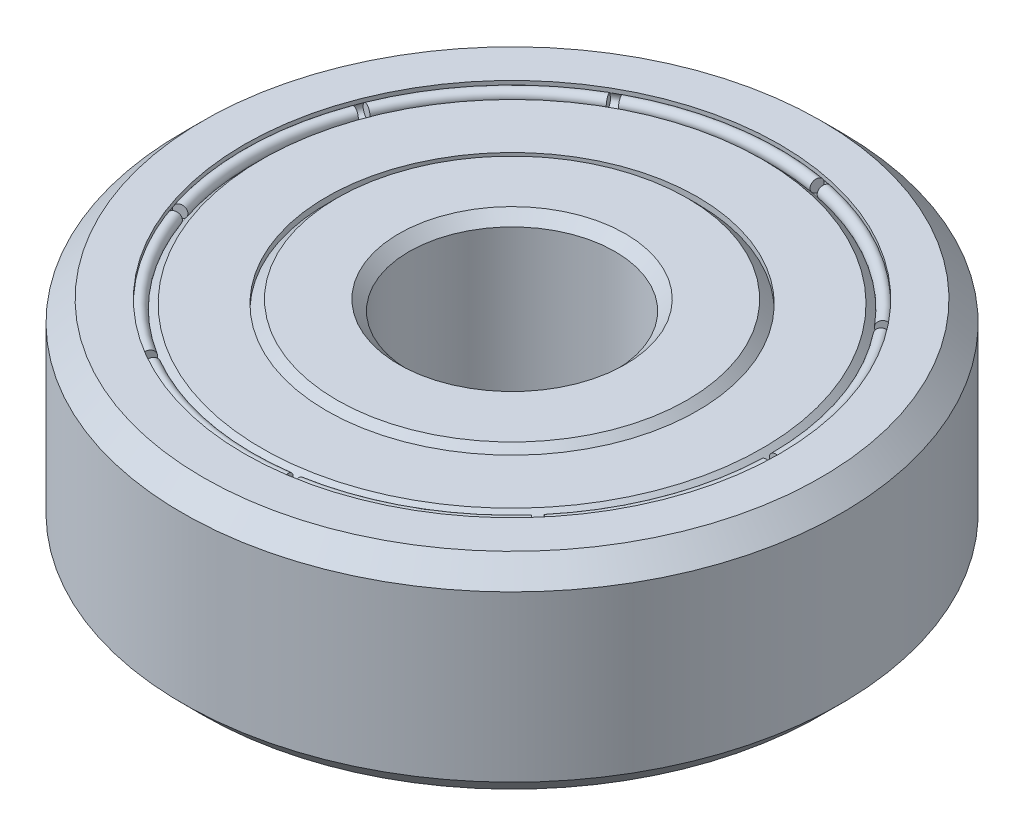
from build123d import *

# Parameters (mm, degrees)
SKETCH2_R         = 0.15
REVOLVE2_ANGLE    = 38
CIRPATTERN1_COUNT = 9


with BuildPart() as part:
    # Sketch1 → Revolve1 (revolve)
    with BuildSketch(Plane.XY, mode=Mode.PRIVATE) as revolve1_sk:
        with BuildLine():
            Line((2.5, -2.25), (2.5, 2.25))
            Line((2.5, 2.25), (2.75, 2.5))
            Line((2.75, 2.5), (4.25, 2.5))
            Line((4.25, 2.5), (4.5, 2.25))
            Line((4.5, 2.25), (4.5, 2.4))
            Line((4.5, 2.4), (6.075735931, 2.4))
            Line((6.075735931, 2.4), (6.287867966, 2.187867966))
            ThreePointArc((6.287867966, 2.187867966), (6.5, 2.187867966), (6.5, 2.4))
            Line((6.5, 2.4), (6.5, 2.5))
            Line((6.5, 2.5), (7.5, 2.5))
            Line((7.5, 2.5), (8, 2))
            Line((8, 2), (8, -2))
            Line((8, -2), (7.5, -2.5))
            Line((7.5, -2.5), (6.5, -2.5))
            Line((6.5, -2.5), (6.5, -2.4))
            ThreePointArc((6.5, -2.4), (6.5, -2.187867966), (6.287867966, -2.187867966))
            Line((6.287867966, -2.187867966), (6.075735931, -2.4))
            Line((6.075735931, -2.4), (4.5, -2.4))
            Line((4.5, -2.4), (4.5, -2.25))
            Line((4.5, -2.25), (4.25, -2.5))
            Line((4.25, -2.5), (2.75, -2.5))
            Line((2.75, -2.5), (2.5, -2.25))
        make_face()
    revolve(revolve1_sk.sketch.rotate(Axis((0, 0, 0), (0, 1, 0)), 90), axis=Axis((0, 0, 0), (0, 1, 0)))


with BuildPart() as body_2:
    # Sketch2 → Revolve2 (revolve)
    with BuildSketch(Plane.XY):
        with Locations((6.393933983, -2.293933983)):
            Circle(SKETCH2_R)
    revolve(axis=Axis((0, 0, 0), (0, 1, 0)), revolution_arc=REVOLVE2_ANGLE)


with BuildPart() as cirpattern1_1:
    # CirPattern1: pattern copy
    add(body_2.part.rotate(Axis((0, 0, 0), (0, 1, 0)), 1 * 360 / CIRPATTERN1_COUNT))


with BuildPart() as cirpattern1_2:
    # CirPattern1: pattern copy
    add(body_2.part.rotate(Axis((0, 0, 0), (0, 1, 0)), 2 * 360 / CIRPATTERN1_COUNT))


with BuildPart() as cirpattern1_3:
    # CirPattern1: pattern copy
    add(body_2.part.rotate(Axis((0, 0, 0), (0, 1, 0)), 3 * 360 / CIRPATTERN1_COUNT))


with BuildPart() as cirpattern1_4:
    # CirPattern1: pattern copy
    add(body_2.part.rotate(Axis((0, 0, 0), (0, 1, 0)), 4 * 360 / CIRPATTERN1_COUNT))


with BuildPart() as cirpattern1_5:
    # CirPattern1: pattern copy
    add(body_2.part.rotate(Axis((0, 0, 0), (0, 1, 0)), 5 * 360 / CIRPATTERN1_COUNT))


with BuildPart() as cirpattern1_6:
    # CirPattern1: pattern copy
    add(body_2.part.rotate(Axis((0, 0, 0), (0, 1, 0)), 6 * 360 / CIRPATTERN1_COUNT))


with BuildPart() as cirpattern1_7:
    # CirPattern1: pattern copy
    add(body_2.part.rotate(Axis((0, 0, 0), (0, 1, 0)), 7 * 360 / CIRPATTERN1_COUNT))


with BuildPart() as cirpattern1_8:
    # CirPattern1: pattern copy
    add(body_2.part.rotate(Axis((0, 0, 0), (0, 1, 0)), 8 * 360 / CIRPATTERN1_COUNT))


with BuildPart() as body_11:
    # Mirror1: mirrored copy
    add(body_2.part.mirror(Plane.ZX))


with BuildPart() as body_12:
    # Mirror1 2: mirrored copy
    add(cirpattern1_8.part.mirror(Plane.ZX))


with BuildPart() as body_13:
    # Mirror1 3: mirrored copy
    add(cirpattern1_7.part.mirror(Plane.ZX))


with BuildPart() as body_14:
    # Mirror1 4: mirrored copy
    add(cirpattern1_6.part.mirror(Plane.ZX))


with BuildPart() as body_15:
    # Mirror1 5: mirrored copy
    add(cirpattern1_5.part.mirror(Plane.ZX))


with BuildPart() as body_16:
    # Mirror1 6: mirrored copy
    add(cirpattern1_4.part.mirror(Plane.ZX))


with BuildPart() as body_17:
    # Mirror1 7: mirrored copy
    add(cirpattern1_3.part.mirror(Plane.ZX))


with BuildPart() as body_18:
    # Mirror1 8: mirrored copy
    add(cirpattern1_2.part.mirror(Plane.ZX))


with BuildPart() as body_19:
    # Mirror1 9: mirrored copy
    add(cirpattern1_1.part.mirror(Plane.ZX))


solid = Compound([part.part, body_2.part, cirpattern1_1.part, cirpattern1_2.part, cirpattern1_3.part, cirpattern1_4.part, cirpattern1_5.part, cirpattern1_6.part, cirpattern1_7.part, cirpattern1_8.part, body_11.part, body_12.part, body_13.part, body_14.part, body_15.part, body_16.part, body_17.part, body_18.part, body_19.part])
